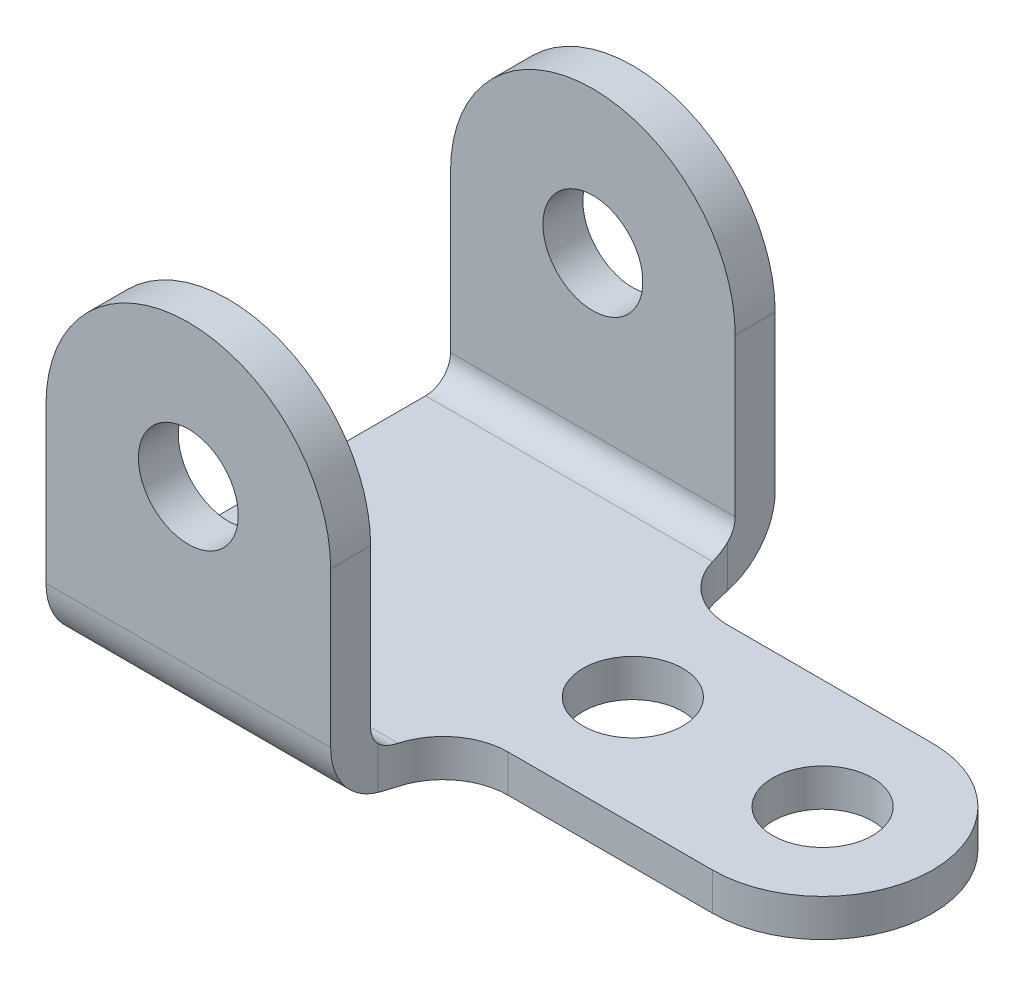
from build123d import *

# Parameters (mm, degrees)
SKETCH2_R           = 10
BOSS_EXTRUDE1_DEPTH = 3.75
FILLET2_R           = 13
SKETCH4_R           = 10
BOSS_EXTRUDE2_DEPTH = 8
FILLET3_R           = 5
FILLET4_R           = 13


with BuildPart() as part:
    # Sketch2 → Boss-Extrude1 (new, symmetric)
    with BuildSketch(Plane(origin=(0, 0, 0), x_dir=(1, 0, 0), z_dir=(0, 1, 0))):
        with BuildLine():
            Line((0, 89), (0, 0))
            Line((0, 0), (57, 0))
            Line((57, 0), (57, 22.5))
            Line((57, 22.5), (111, 22.5))
            ThreePointArc((111, 22.5), (133, 44.5), (111, 66.5))
            Line((111, 66.5), (57, 66.5))
            Line((57, 66.5), (57, 89))
            Line((57, 89), (0, 89))
        make_face()
        with Locations(Location((111, 44.5, 0), (0, 0, 270))):
            Circle(SKETCH2_R, mode=Mode.SUBTRACT)
        with Locations(Location((73, 44.5, 0), (0, 0, 270))):
            Circle(SKETCH2_R, mode=Mode.SUBTRACT)
    extrude(amount=BOSS_EXTRUDE1_DEPTH, both=True)

    # Fillet2
    fillet2_edges = [part.edges().sort_by_distance(p)[0] for p in [
        (57, 0, -66.5),
        (57, 0, -22.5),
    ]]
    fillet(fillet2_edges, radius=FILLET2_R)

    # Sketch4 → Boss-Extrude2 (add)
    with BuildSketch(Plane(origin=(0, 0, 0), x_dir=(1, 0, 0), z_dir=(0, 0, -1))):
        with BuildLine():
            Line((0, -3.75), (0, -40.25))
            ThreePointArc((0, -40.25), (28.5, -68.75), (57, -40.25))
            Line((57, -40.25), (57, -3.75))
            Line((57, -3.75), (0, -3.75))
        make_face()
        with Locations(Location((28.5, -40.25, 0), (0, 0, 180))):
            Circle(SKETCH4_R, mode=Mode.SUBTRACT)
    boss_extrude2 = extrude(amount=BOSS_EXTRUDE2_DEPTH)

    # Mirror2: Boss-Extrude2 across plane
    add(boss_extrude2.mirror(Plane(origin=(0, 0, -44.5), x_dir=(1, 0, 0), z_dir=(0, 0, -1))))

    # Fillet3
    fillet3_edges = [part.edges().sort_by_distance(p)[0] for p in [
        (28.5, 3.75, -8),
        (28.5, 3.75, -81),
    ]]
    fillet(fillet3_edges, radius=FILLET3_R)

    # Fillet4
    fillet4_edges = [part.edges().sort_by_distance(p)[0] for p in [
        (28.5, -3.75, 0),
        (28.5, -3.75, -89),
    ]]
    fillet(fillet4_edges, radius=FILLET4_R)


solid = part.part
